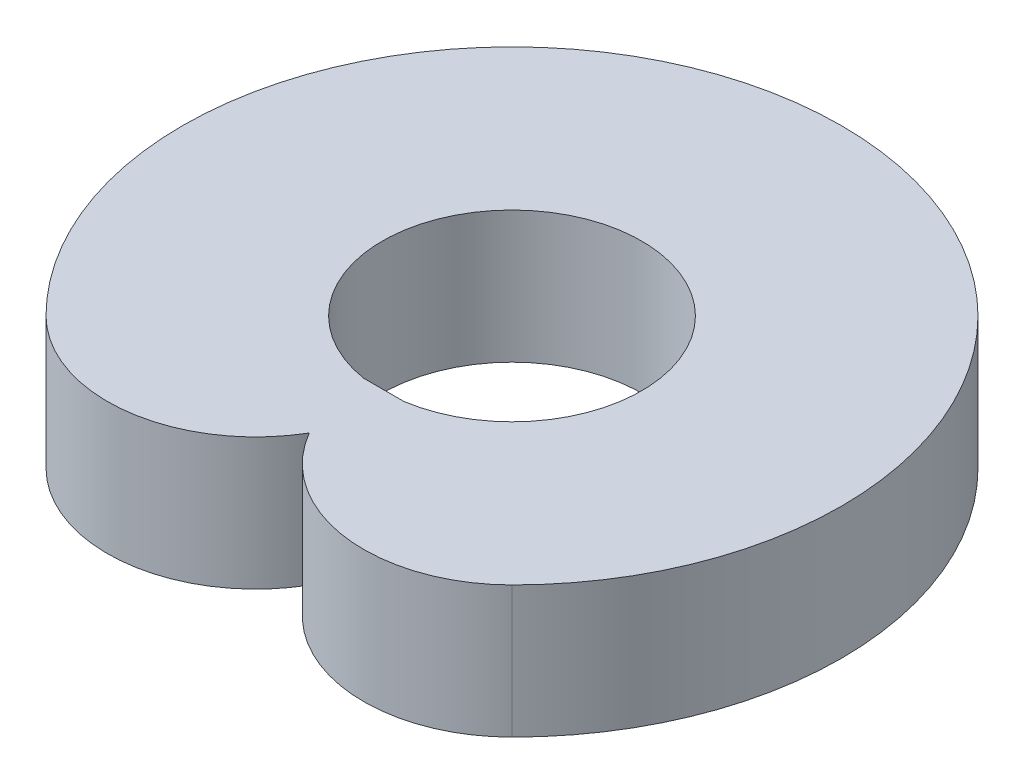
from build123d import *

# Parameters (mm, degrees)
EXTRUDE_1_DEPTH = 400


with BuildPart() as part:
    # Sketch 1 → Extrude 1 (new body)
    with BuildSketch(Plane(origin=(0, 0, 0), x_dir=(1, 0, 0), z_dir=(0, 1, 0))):
        with BuildLine():
            ThreePointArc((707.106781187, -707.106781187), (0, 1000), (-707.106781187, -707.106781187))
            ThreePointArc((-707.106781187, -707.106781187), (-330.965428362, -835.162663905), (0, -615.293358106))
            ThreePointArc((0, -615.293358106), (330.965428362, -835.162663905), (707.106781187, -707.106781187))
        make_face()
        with BuildLine():
            Line((61.091270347, -388.908729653), (-61.091270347, -388.908729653))
            ThreePointArc((-61.091270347, -388.908729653), (0, 393.677715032), (61.091270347, -388.908729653))
        make_face(mode=Mode.SUBTRACT)
    extrude(amount=EXTRUDE_1_DEPTH)


solid = part.part
